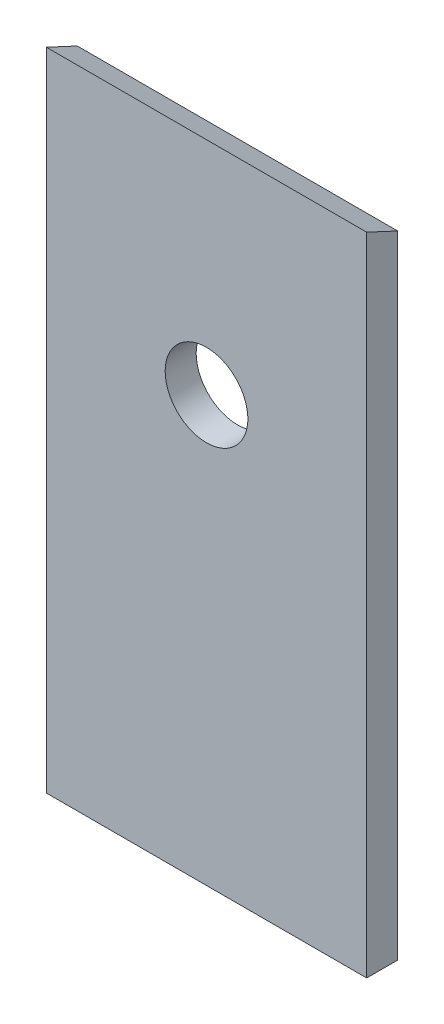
ISO-10303-21;
HEADER;
FILE_DESCRIPTION(('STEP AP214'),'2;1');
FILE_NAME('part.step','',(''),(''),'','','');
FILE_SCHEMA(('AUTOMOTIVE_DESIGN { 1 0 10303 214 1 1 1 1 }'));
ENDSEC;
DATA;
#1=APPLICATION_CONTEXT('core data for automotive mechanical design processes');
#2=APPLICATION_PROTOCOL_DEFINITION('international standard','automotive_design',2000,#1);
#3=PRODUCT_CONTEXT('',#1,'mechanical');
#4=PRODUCT('Part','Part','',(#3));
#5=PRODUCT_RELATED_PRODUCT_CATEGORY('part','',(#4));
#6=PRODUCT_DEFINITION_FORMATION('','',#4);
#7=PRODUCT_DEFINITION_CONTEXT('part definition',#1,'design');
#8=PRODUCT_DEFINITION('design','',#6,#7);
#9=PRODUCT_DEFINITION_SHAPE('','',#8);
#10=(LENGTH_UNIT() NAMED_UNIT(*) SI_UNIT(.MILLI.,.METRE.));
#11=(NAMED_UNIT(*) PLANE_ANGLE_UNIT() SI_UNIT($,.RADIAN.));
#12=(NAMED_UNIT(*) SI_UNIT($,.STERADIAN.) SOLID_ANGLE_UNIT());
#13=UNCERTAINTY_MEASURE_WITH_UNIT(LENGTH_MEASURE(1.E-05),#10,'distance_accuracy_value','');
#14=(GEOMETRIC_REPRESENTATION_CONTEXT(3) GLOBAL_UNCERTAINTY_ASSIGNED_CONTEXT((#13)) GLOBAL_UNIT_ASSIGNED_CONTEXT((#10,
#11,#12)) REPRESENTATION_CONTEXT('',''));
#15=CARTESIAN_POINT('',(0.,0.,0.));
#16=DIRECTION('',(0.,0.,1.));
#17=DIRECTION('',(1.,0.,0.));
#18=AXIS2_PLACEMENT_3D('',#15,#16,#17);
#19=CARTESIAN_POINT('',(124.,0.,0.));
#20=DIRECTION('',(0.,1.,0.));
#21=DIRECTION('',(0.,0.,1.));
#22=AXIS2_PLACEMENT_3D('',#19,#20,#21);
#23=PLANE('',#22);
#24=DIRECTION('',(0.,0.,-1.));
#25=VECTOR('',#24,1.);
#26=CARTESIAN_POINT('',(0.,0.,0.));
#27=LINE('',#26,#25);
#28=CARTESIAN_POINT('',(0.,0.,0.));
#29=VERTEX_POINT('',#28);
#30=CARTESIAN_POINT('',(0.,0.,-12.));
#31=VERTEX_POINT('',#30);
#32=EDGE_CURVE('E107',#29,#31,#27,.T.);
#33=ORIENTED_EDGE('',*,*,#32,.T.);
#34=DIRECTION('',(-1.,0.,0.));
#35=VECTOR('',#34,1.);
#36=CARTESIAN_POINT('',(124.,0.,-12.));
#37=LINE('',#36,#35);
#38=CARTESIAN_POINT('',(124.,0.,-12.));
#39=VERTEX_POINT('',#38);
#40=EDGE_CURVE('E11',#39,#31,#37,.T.);
#41=ORIENTED_EDGE('',*,*,#40,.F.);
#42=DIRECTION('',(0.,0.,-1.));
#43=VECTOR('',#42,1.);
#44=CARTESIAN_POINT('',(124.,0.,0.));
#45=LINE('',#44,#43);
#46=CARTESIAN_POINT('',(124.,0.,0.));
#47=VERTEX_POINT('',#46);
#48=EDGE_CURVE('E89',#47,#39,#45,.T.);
#49=ORIENTED_EDGE('',*,*,#48,.F.);
#50=DIRECTION('',(-1.,0.,0.));
#51=VECTOR('',#50,1.);
#52=CARTESIAN_POINT('',(124.,0.,0.));
#53=LINE('',#52,#51);
#54=EDGE_CURVE('E56',#47,#29,#53,.T.);
#55=ORIENTED_EDGE('',*,*,#54,.T.);
#56=EDGE_LOOP('',(#33,#41,#49,#55));
#57=FACE_BOUND('',#56,.T.);
#58=ADVANCED_FACE('F39',(#57),#23,.F.);
#59=CARTESIAN_POINT('',(124.,0.,-12.));
#60=DIRECTION('',(0.,0.,1.));
#61=DIRECTION('',(1.,0.,0.));
#62=AXIS2_PLACEMENT_3D('',#59,#60,#61);
#63=PLANE('',#62);
#64=CARTESIAN_POINT('',(62.,164.40430810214,-12.));
#65=DIRECTION('',(0.,0.,-1.));
#66=DIRECTION('',(-1.,0.,0.));
#67=AXIS2_PLACEMENT_3D('',#64,#65,#66);
#68=CIRCLE('',#67,16.);
#69=CARTESIAN_POINT('',(46.,164.40430810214,-12.));
#70=VERTEX_POINT('',#69);
#71=EDGE_CURVE('E126',#70,#70,#68,.T.);
#72=ORIENTED_EDGE('',*,*,#71,.F.);
#73=EDGE_LOOP('',(#72));
#74=FACE_BOUND('',#73,.T.);
#75=DIRECTION('',(0.,1.,0.));
#76=VECTOR('',#75,1.);
#77=CARTESIAN_POINT('',(0.,0.,-12.));
#78=LINE('',#77,#76);
#79=CARTESIAN_POINT('',(0.,244.40430810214,-12.));
#80=VERTEX_POINT('',#79);
#81=EDGE_CURVE('E95',#31,#80,#78,.T.);
#82=ORIENTED_EDGE('',*,*,#81,.T.);
#83=DIRECTION('',(-1.,0.,0.));
#84=VECTOR('',#83,1.);
#85=CARTESIAN_POINT('',(124.,244.40430810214,-12.));
#86=LINE('',#85,#84);
#87=CARTESIAN_POINT('',(124.,244.40430810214,-12.));
#88=VERTEX_POINT('',#87);
#89=EDGE_CURVE('E48',#88,#80,#86,.T.);
#90=ORIENTED_EDGE('',*,*,#89,.F.);
#91=DIRECTION('',(0.,1.,0.));
#92=VECTOR('',#91,1.);
#93=CARTESIAN_POINT('',(124.,0.,-12.));
#94=LINE('',#93,#92);
#95=EDGE_CURVE('E81',#39,#88,#94,.T.);
#96=ORIENTED_EDGE('',*,*,#95,.F.);
#97=ORIENTED_EDGE('',*,*,#40,.T.);
#98=EDGE_LOOP('',(#82,#90,#96,#97));
#99=FACE_BOUND('',#98,.T.);
#100=ADVANCED_FACE('F94',(#74,#99),#63,.F.);
#101=CARTESIAN_POINT('',(124.,250.,0.));
#102=DIRECTION('',(0.,0.906307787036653,-0.422618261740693));
#103=DIRECTION('',(0.,0.422618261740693,0.906307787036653));
#104=AXIS2_PLACEMENT_3D('',#101,#102,#103);
#105=PLANE('',#104);
#106=DIRECTION('',(0.,-0.422618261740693,-0.906307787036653));
#107=VECTOR('',#106,1.);
#108=CARTESIAN_POINT('',(0.,250.,0.));
#109=LINE('',#108,#107);
#110=CARTESIAN_POINT('',(0.,250.,0.));
#111=VERTEX_POINT('',#110);
#112=EDGE_CURVE('E113',#111,#80,#109,.T.);
#113=ORIENTED_EDGE('',*,*,#112,.F.);
#114=DIRECTION('',(-1.,0.,0.));
#115=VECTOR('',#114,1.);
#116=CARTESIAN_POINT('',(124.,250.,0.));
#117=LINE('',#116,#115);
#118=CARTESIAN_POINT('',(124.,250.,0.));
#119=VERTEX_POINT('',#118);
#120=EDGE_CURVE('E70',#119,#111,#117,.T.);
#121=ORIENTED_EDGE('',*,*,#120,.F.);
#122=DIRECTION('',(0.,-0.422618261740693,-0.906307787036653));
#123=VECTOR('',#122,1.);
#124=CARTESIAN_POINT('',(124.,250.,0.));
#125=LINE('',#124,#123);
#126=EDGE_CURVE('E88',#119,#88,#125,.T.);
#127=ORIENTED_EDGE('',*,*,#126,.T.);
#128=ORIENTED_EDGE('',*,*,#89,.T.);
#129=EDGE_LOOP('',(#113,#121,#127,#128));
#130=FACE_BOUND('',#129,.T.);
#131=ADVANCED_FACE('F99',(#130),#105,.T.);
#132=CARTESIAN_POINT('',(124.,0.,0.));
#133=DIRECTION('',(0.,0.,1.));
#134=DIRECTION('',(1.,0.,0.));
#135=AXIS2_PLACEMENT_3D('',#132,#133,#134);
#136=PLANE('',#135);
#137=CARTESIAN_POINT('',(62.,164.40430810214,0.));
#138=DIRECTION('',(0.,0.,-1.));
#139=DIRECTION('',(-1.,0.,0.));
#140=AXIS2_PLACEMENT_3D('',#137,#138,#139);
#141=CIRCLE('',#140,16.);
#142=CARTESIAN_POINT('',(46.,164.40430810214,0.));
#143=VERTEX_POINT('',#142);
#144=EDGE_CURVE('E110',#143,#143,#141,.T.);
#145=ORIENTED_EDGE('',*,*,#144,.T.);
#146=EDGE_LOOP('',(#145));
#147=FACE_BOUND('',#146,.T.);
#148=DIRECTION('',(0.,1.,0.));
#149=VECTOR('',#148,1.);
#150=CARTESIAN_POINT('',(0.,0.,0.));
#151=LINE('',#150,#149);
#152=EDGE_CURVE('E116',#29,#111,#151,.T.);
#153=ORIENTED_EDGE('',*,*,#152,.F.);
#154=ORIENTED_EDGE('',*,*,#54,.F.);
#155=DIRECTION('',(0.,1.,0.));
#156=VECTOR('',#155,1.);
#157=CARTESIAN_POINT('',(124.,0.,0.));
#158=LINE('',#157,#156);
#159=EDGE_CURVE('E101',#47,#119,#158,.T.);
#160=ORIENTED_EDGE('',*,*,#159,.T.);
#161=ORIENTED_EDGE('',*,*,#120,.T.);
#162=EDGE_LOOP('',(#153,#154,#160,#161));
#163=FACE_BOUND('',#162,.T.);
#164=ADVANCED_FACE('F134',(#147,#163),#136,.T.);
#165=CARTESIAN_POINT('',(124.,0.,0.));
#166=DIRECTION('',(1.,0.,0.));
#167=DIRECTION('',(0.,0.,-1.));
#168=AXIS2_PLACEMENT_3D('',#165,#166,#167);
#169=PLANE('',#168);
#170=ORIENTED_EDGE('',*,*,#48,.T.);
#171=ORIENTED_EDGE('',*,*,#95,.T.);
#172=ORIENTED_EDGE('',*,*,#126,.F.);
#173=ORIENTED_EDGE('',*,*,#159,.F.);
#174=EDGE_LOOP('',(#170,#171,#172,#173));
#175=FACE_BOUND('',#174,.T.);
#176=ADVANCED_FACE('F85',(#175),#169,.T.);
#177=CARTESIAN_POINT('',(0.,0.,0.));
#178=DIRECTION('',(1.,0.,0.));
#179=DIRECTION('',(0.,0.,-1.));
#180=AXIS2_PLACEMENT_3D('',#177,#178,#179);
#181=PLANE('',#180);
#182=ORIENTED_EDGE('',*,*,#32,.F.);
#183=ORIENTED_EDGE('',*,*,#152,.T.);
#184=ORIENTED_EDGE('',*,*,#112,.T.);
#185=ORIENTED_EDGE('',*,*,#81,.F.);
#186=EDGE_LOOP('',(#182,#183,#184,#185));
#187=FACE_BOUND('',#186,.T.);
#188=ADVANCED_FACE('F139',(#187),#181,.F.);
#189=CARTESIAN_POINT('',(62.,164.40430810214,0.));
#190=DIRECTION('',(0.,0.,-1.));
#191=DIRECTION('',(-1.,0.,0.));
#192=AXIS2_PLACEMENT_3D('',#189,#190,#191);
#193=CYLINDRICAL_SURFACE('',#192,16.);
#194=ORIENTED_EDGE('',*,*,#144,.F.);
#195=EDGE_LOOP('',(#194));
#196=FACE_BOUND('',#195,.T.);
#197=ORIENTED_EDGE('',*,*,#71,.T.);
#198=EDGE_LOOP('',(#197));
#199=FACE_BOUND('',#198,.T.);
#200=ADVANCED_FACE('F136',(#196,#199),#193,.F.);
#201=CLOSED_SHELL('',(#58,#100,#131,#164,#176,#188,#200));
#202=MANIFOLD_SOLID_BREP('B2',#201);
#203=ADVANCED_BREP_SHAPE_REPRESENTATION('',(#18,#202),#14);
#204=SHAPE_DEFINITION_REPRESENTATION(#9,#203);
ENDSEC;
END-ISO-10303-21;
